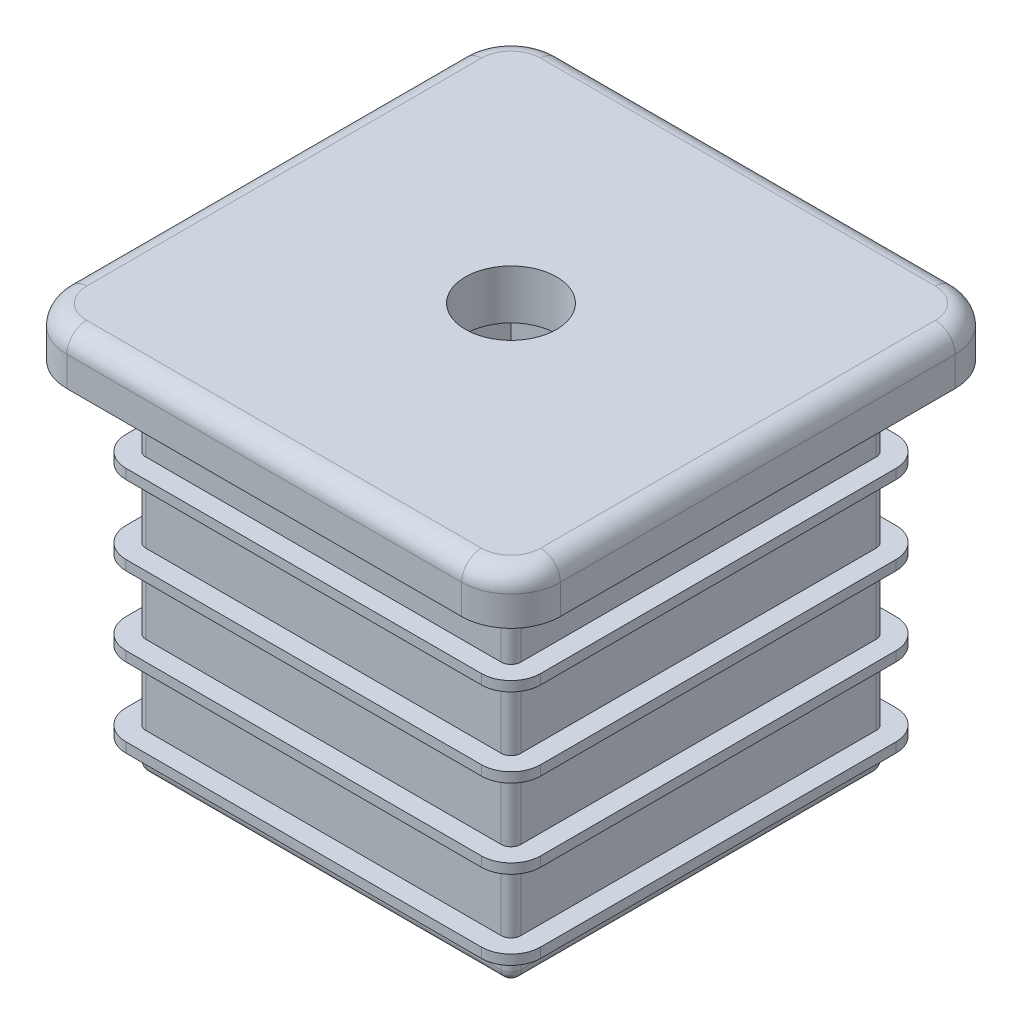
from build123d import *

# Parameters (mm, degrees)
BOSS_EXTRU_1_DEPTH         = 2.5
CONG_1_R                   = 1
ESQUISSE2_W                = 19
ESQUISSE2_H                = 19
ESQUISSE2_W_2              = 16
ESQUISSE2_H_2              = 16
EXTRU_MINCE1_DEPTH         = 18
CONG_2_R                   = 0.5
CONG_3_R                   = 0.5
BOSS_EXTRU_2_START         = 0.5
BOSS_EXTRU_2_DEPTH         = 0.5
R_P_TITION_LIN_AIRE1_COUNT = 4
R_P_TITION_LIN_AIRE1_PITCH = 4
ESQUISSE4_R                = 2.31
ENL_V_MAT_EXTRU_1_DEPTH    = 28.069355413


with BuildPart() as part:
    # Esquisse1 → Boss.-Extru.1 (new body)
    with BuildSketch(Plane(origin=(0, 0, 0), x_dir=(1, 0, 0), z_dir=(0, 1, 0))):
        with BuildLine():
            Line((-10, 12.5), (10, 12.5))
            ThreePointArc((10, 12.5), (11.767766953, 11.767766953), (12.5, 10))
            Line((12.5, 10), (12.5, -10))
            ThreePointArc((12.5, -10), (11.767766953, -11.767766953), (10, -12.5))
            Line((10, -12.5), (-10, -12.5))
            ThreePointArc((-10, -12.5), (-11.767766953, -11.767766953), (-12.5, -10))
            Line((-12.5, -10), (-12.5, 10))
            ThreePointArc((-12.5, 10), (-11.767766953, 11.767766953), (-10, 12.5))
        make_face()
    extrude(amount=BOSS_EXTRU_1_DEPTH)

    # Cong_1
    cong_1_edges = [part.edges().sort_by_distance(p)[0] for p in [
        (11.767766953, 2.5, 11.767766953),
        (12.5, 2.5, 0),
        (11.767766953, 2.5, -11.767766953),
        (0, 2.5, -12.5),
        (-11.767766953, 2.5, -11.767766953),
        (-12.5, 2.5, 0),
        (-11.767766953, 2.5, 11.767766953),
        (0, 2.5, 12.5),
    ]]
    fillet(cong_1_edges, radius=CONG_1_R)

    # Esquisse2 → Extru.-Mince1 (add)
    with BuildSketch(Plane.XZ):
        Rectangle(ESQUISSE2_W, ESQUISSE2_H)
        Rectangle(ESQUISSE2_W_2, ESQUISSE2_H_2, mode=Mode.SUBTRACT)
    extrude(amount=EXTRU_MINCE1_DEPTH)

    # Cong_2
    cong_2_edges = [part.edges().sort_by_distance(p)[0] for p in [
        (9.5, -9, -9.5),
        (9.5, -9, 9.5),
        (-9.5, -9, 9.5),
        (-9.5, -9, -9.5),
    ]]
    fillet(cong_2_edges, radius=CONG_2_R)

    # Cong_3
    cong_3_edges = [part.edges().sort_by_distance(p)[0] for p in [
        (-9.5, -18, 0),
        (0, -18, 9.5),
        (9.5, -18, 0),
        (0, -18, -9.5),
        (9.353553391, -18, -9.353553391),
        (9.353553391, -18, 9.353553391),
        (-9.353553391, -18, -9.353553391),
        (-9.353553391, -18, 9.353553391),
    ]]
    fillet(cong_3_edges, radius=CONG_3_R)

    # Esquisse3 → Boss.-Extru.2 (add)
    with BuildSketch(Plane(origin=(0, -4, 0), x_dir=(-1, 0, 0), z_dir=(0, -1, 0)).offset(BOSS_EXTRU_2_START)):
        with BuildLine():
            Line((10.5, -9), (10.5, 9))
            ThreePointArc((10.5, 9), (10.060660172, 10.060660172), (9, 10.5))
            Line((9, 10.5), (-9, 10.5))
            ThreePointArc((-9, 10.5), (-10.060660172, 10.060660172), (-10.5, 9))
            Line((-10.5, 9), (-10.5, -9))
            ThreePointArc((-10.5, -9), (-10.060660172, -10.060660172), (-9, -10.5))
            Line((-9, -10.5), (9, -10.5))
            ThreePointArc((9, -10.5), (10.060660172, -10.060660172), (10.5, -9))
        make_face()
        with BuildLine():
            Line((9.5, -9), (9.5, 9))
            ThreePointArc((9.5, 9), (9.353553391, 9.353553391), (9, 9.5))
            Line((9, 9.5), (-9, 9.5))
            ThreePointArc((-9, 9.5), (-9.353553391, 9.353553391), (-9.5, 9))
            Line((-9.5, 9), (-9.5, -9))
            ThreePointArc((-9.5, -9), (-9.353553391, -9.353553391), (-9, -9.5))
            Line((-9, -9.5), (9, -9.5))
            ThreePointArc((9, -9.5), (9.353553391, -9.353553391), (9.5, -9))
        make_face(mode=Mode.SUBTRACT)
    boss_extru_2 = extrude(amount=-BOSS_EXTRU_2_DEPTH)

    # R_p_tition lin_aire1: Boss.-Extru.2 ×4
    with Locations(*[(0, -i * R_P_TITION_LIN_AIRE1_PITCH, 0) for i in range(1, R_P_TITION_LIN_AIRE1_COUNT)]):
        add(boss_extru_2)

    # Esquisse4 → Enl_v. mat.-Extru.1 (cut, through all)
    with BuildSketch(Plane(origin=(0, 2.5, 0), x_dir=(1, 0, 0), z_dir=(0, 1, 0))):
        with Locations(Location((0, 0, 0), (0, 0, 270))):
            Circle(ESQUISSE4_R)
    extrude(amount=-ENL_V_MAT_EXTRU_1_DEPTH, mode=Mode.SUBTRACT)


solid = part.part
